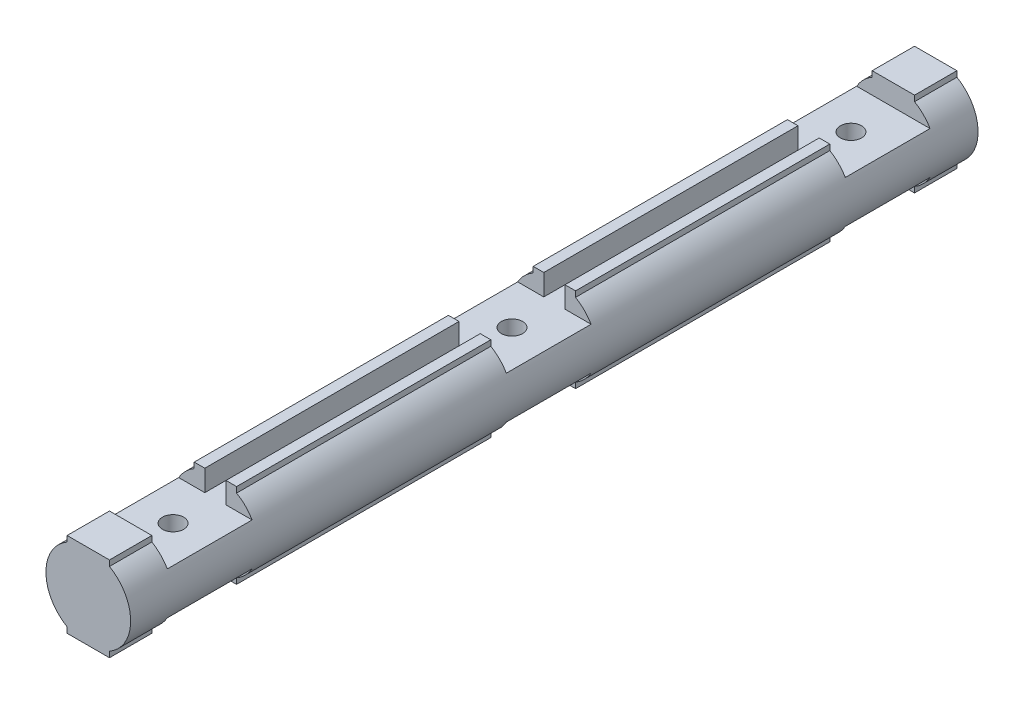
from build123d import *

# Parameters (mm, degrees)
SKETCH1_R               = 10
BOSS_EXTRUDE1_DEPTH     = 100
SKETCH2_W               = 10
SKETCH2_H               = 20
BOSS_EXTRUDE2_DEPTH     = 200
SKETCH3_W               = 17.320508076
SKETCH3_H               = 5
CUT_EXTRUDE1_DEPTH      = 10
SKETCH4_R               = 2.5
CUT_EXTRUDE3_DEPTH      = 102.612007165
SKETCH5_W               = 5
SKETCH5_H               = 140
CUT_EXTRUDE2_DEPTH      = 5
LPATTERN1_COUNT         = 3
LPATTERN1_PITCH         = 80
MIRROR1_COPY_1_SKETCH_W = 17.320508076
MIRROR1_COPY_1_SKETCH_H = 5
MIRROR1_COPY_1_DEPTH    = 10
MIRROR1_COPY_2_SKETCH_W = 17.320508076
MIRROR1_COPY_2_SKETCH_H = 5
MIRROR1_COPY_2_DEPTH    = 10
MIRROR1_COPY_3_SKETCH_R = 2.5
MIRROR1_COPY_3_DEPTH    = 102.612007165
MIRROR1_COPY_4_SKETCH_R = 2.5
MIRROR1_COPY_4_DEPTH    = 102.612007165
MIRROR1_COPY_5_SKETCH_R = 2.5
MIRROR1_COPY_5_DEPTH    = 102.612007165


with BuildPart() as part:
    # Sketch1 → Boss-Extrude1 (new, symmetric)
    with BuildSketch(Plane.XY):
        Circle(SKETCH1_R)
    extrude(amount=BOSS_EXTRUDE1_DEPTH, both=True)

    # Sketch2 → Boss-Extrude2 (add)
    with BuildSketch(Plane.XY.offset(100)):
        Rectangle(SKETCH2_W, SKETCH2_H)
    extrude(amount=-BOSS_EXTRUDE2_DEPTH)

    # Sketch3 → Cut-Extrude1 (cut, symmetric)
    with BuildSketch(Plane.XY.offset(-80)):
        with Locations((0, 7.5)):
            Rectangle(SKETCH3_W, SKETCH3_H)
    cut_extrude1 = extrude(amount=CUT_EXTRUDE1_DEPTH, both=True, mode=Mode.SUBTRACT)

    # Sketch4 → Cut-Extrude3 (cut, through all)
    with BuildSketch(Plane(origin=(0, 5, 0), x_dir=(1, 0, 0), z_dir=(0, 1, 0))):
        with Locations(Location((0, 80, 0), (0, 0, 270))):
            Circle(SKETCH4_R)
    cut_extrude3 = extrude(amount=-CUT_EXTRUDE3_DEPTH, mode=Mode.SUBTRACT)

    # Sketch5 → Cut-Extrude2 (cut)
    with BuildSketch(Plane(origin=(0, 10, 0), x_dir=(1, 0, 0), z_dir=(0, 1, 0))):
        Rectangle(SKETCH5_W, SKETCH5_H)
    cut_extrude2 = extrude(amount=-CUT_EXTRUDE2_DEPTH, mode=Mode.SUBTRACT)

    # LPattern1: Cut-Extrude1, Cut-Extrude3 ×3
    with Locations(*[(0, 0, i * LPATTERN1_PITCH) for i in range(1, LPATTERN1_COUNT)]):
        add(cut_extrude1, mode=Mode.SUBTRACT)
        add(cut_extrude3, mode=Mode.SUBTRACT)

    # Mirror1: Cut-Extrude1, Cut-Extrude2 across plane
    add(cut_extrude1.mirror(Plane.ZX), mode=Mode.SUBTRACT)
    add(cut_extrude2.mirror(Plane.ZX), mode=Mode.SUBTRACT)

    # Mirror1 copy 1 sketch → Mirror1 copy 1 (cut, symmetric)
    with BuildSketch(Plane.XY):
        with Locations((0, -7.5)):
            Rectangle(MIRROR1_COPY_1_SKETCH_W, MIRROR1_COPY_1_SKETCH_H)
    extrude(amount=MIRROR1_COPY_1_DEPTH, both=True, mode=Mode.SUBTRACT)

    # Mirror1 copy 2 sketch → Mirror1 copy 2 (cut, symmetric)
    with BuildSketch(Plane.XY.offset(80)):
        with Locations((0, -7.5)):
            Rectangle(MIRROR1_COPY_2_SKETCH_W, MIRROR1_COPY_2_SKETCH_H)
    extrude(amount=MIRROR1_COPY_2_DEPTH, both=True, mode=Mode.SUBTRACT)

    # Mirror1 copy 3 sketch → Mirror1 copy 3 (cut, through all)
    with BuildSketch(Plane(origin=(0, -5, 80), x_dir=(1, 0, 0), z_dir=(0, -1, 0))):
        with Locations((0, -80)):
            Circle(MIRROR1_COPY_3_SKETCH_R)
    extrude(amount=-MIRROR1_COPY_3_DEPTH, mode=Mode.SUBTRACT)

    # Mirror1 copy 4 sketch → Mirror1 copy 4 (cut, through all)
    with BuildSketch(Plane(origin=(0, -5, 160), x_dir=(1, 0, 0), z_dir=(0, -1, 0))):
        with Locations((0, -80)):
            Circle(MIRROR1_COPY_4_SKETCH_R)
    extrude(amount=-MIRROR1_COPY_4_DEPTH, mode=Mode.SUBTRACT)

    # Mirror1 copy 5 sketch → Mirror1 copy 5 (cut, through all)
    with BuildSketch(Plane.XZ.offset(5)):
        with Locations((0, -80)):
            Circle(MIRROR1_COPY_5_SKETCH_R)
    extrude(amount=-MIRROR1_COPY_5_DEPTH, mode=Mode.SUBTRACT)


solid = part.part
